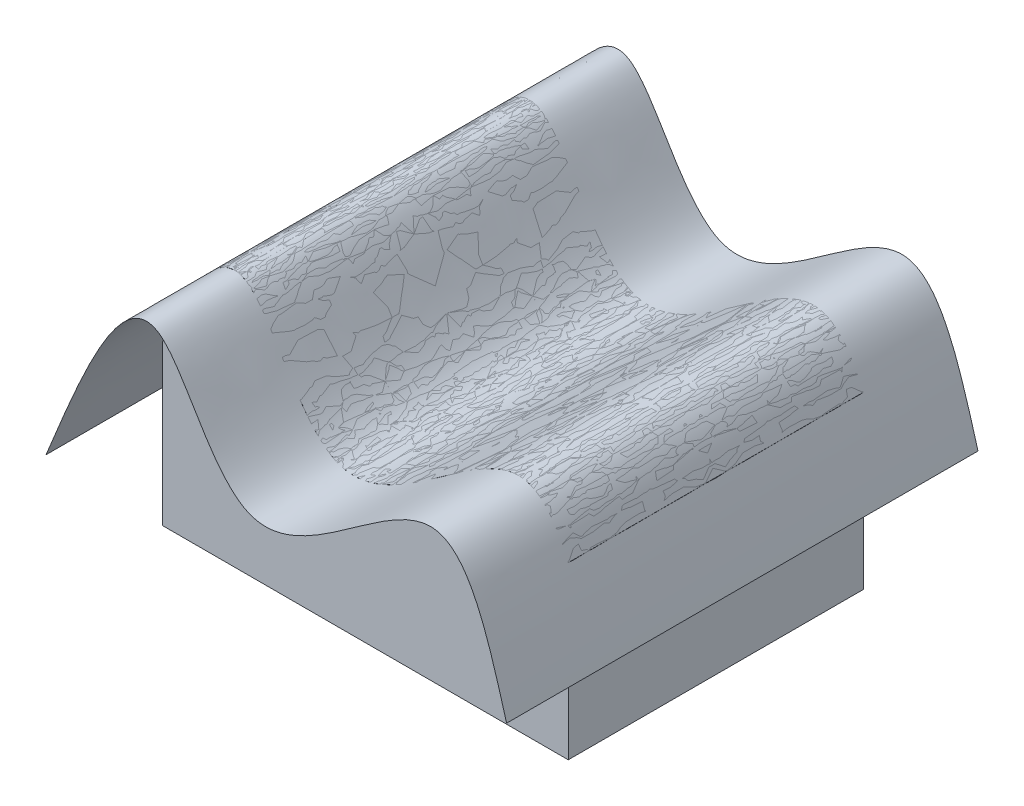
ISO-10303-21;
HEADER;
FILE_DESCRIPTION(('STEP AP214'),'2;1');
FILE_NAME('part.step','',(''),(''),'','','');
FILE_SCHEMA(('AUTOMOTIVE_DESIGN { 1 0 10303 214 1 1 1 1 }'));
ENDSEC;
DATA;
#1=APPLICATION_CONTEXT('core data for automotive mechanical design processes');
#2=APPLICATION_PROTOCOL_DEFINITION('international standard','automotive_design',2000,#1);
#3=PRODUCT_CONTEXT('',#1,'mechanical');
#4=PRODUCT('Part','Part','',(#3));
#5=PRODUCT_RELATED_PRODUCT_CATEGORY('part','',(#4));
#6=PRODUCT_DEFINITION_FORMATION('','',#4);
#7=PRODUCT_DEFINITION_CONTEXT('part definition',#1,'design');
#8=PRODUCT_DEFINITION('design','',#6,#7);
#9=PRODUCT_DEFINITION_SHAPE('','',#8);
#10=(LENGTH_UNIT() NAMED_UNIT(*) SI_UNIT(.MILLI.,.METRE.));
#11=(NAMED_UNIT(*) PLANE_ANGLE_UNIT() SI_UNIT($,.RADIAN.));
#12=(NAMED_UNIT(*) SI_UNIT($,.STERADIAN.) SOLID_ANGLE_UNIT());
#13=UNCERTAINTY_MEASURE_WITH_UNIT(LENGTH_MEASURE(1.E-05),#10,'distance_accuracy_value','');
#14=(GEOMETRIC_REPRESENTATION_CONTEXT(3) GLOBAL_UNCERTAINTY_ASSIGNED_CONTEXT((#13)) GLOBAL_UNIT_ASSIGNED_CONTEXT((#10,
#11,#12)) REPRESENTATION_CONTEXT('',''));
#15=CARTESIAN_POINT('',(0.,0.,0.));
#16=DIRECTION('',(0.,0.,1.));
#17=DIRECTION('',(1.,0.,0.));
#18=AXIS2_PLACEMENT_3D('',#15,#16,#17);
#19=CARTESIAN_POINT('',(-69.1741102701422,-2.69924633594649,-70.5138398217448));
#20=CARTESIAN_POINT('',(-57.8502774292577,25.0636272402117,-70.5138398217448));
#21=CARTESIAN_POINT('',(-38.1766225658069,73.2979309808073,-70.5138398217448));
#22=CARTESIAN_POINT('',(-9.11600174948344,-16.2820314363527,-70.5138398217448));
#23=CARTESIAN_POINT('',(50.3210809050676,60.8549096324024,-70.5138398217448));
#24=CARTESIAN_POINT('',(63.1056676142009,16.022012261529,-70.5138398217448));
#25=CARTESIAN_POINT('',(68.6261598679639,-3.33721054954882,-70.5138398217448));
#26=B_SPLINE_CURVE_WITH_KNOTS('',3,(#19,#20,#21,#22,#23,#24,#25),.UNSPECIFIED.,.F.,.F.,(4,1,1,1,
4),(0.,0.28457012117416,0.494402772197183,0.781678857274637,1.),.UNSPECIFIED.);
#27=DIRECTION('',(0.,0.,1.));
#28=VECTOR('',#27,1.);
#29=SURFACE_OF_LINEAR_EXTRUSION('',#26,#28);
#30=CARTESIAN_POINT('',(-69.1741102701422,-2.69924633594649,70.5138398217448));
#31=CARTESIAN_POINT('',(-57.8502774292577,25.0636272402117,70.5138398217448));
#32=CARTESIAN_POINT('',(-38.1766225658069,73.2979309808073,70.5138398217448));
#33=CARTESIAN_POINT('',(-9.11600174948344,-16.2820314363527,70.5138398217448));
#34=CARTESIAN_POINT('',(50.3210809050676,60.8549096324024,70.5138398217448));
#35=CARTESIAN_POINT('',(63.1056676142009,16.022012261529,70.5138398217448));
#36=CARTESIAN_POINT('',(68.6261598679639,-3.33721054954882,70.5138398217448));
#37=B_SPLINE_CURVE_WITH_KNOTS('',3,(#30,#31,#32,#33,#34,#35,#36),.UNSPECIFIED.,.F.,.F.,(4,1,1,1,
4),(0.,0.28457012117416,0.494402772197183,0.781678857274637,1.),.UNSPECIFIED.);
#38=CARTESIAN_POINT('',(-69.1741102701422,-2.69924633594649,70.5138398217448));
#39=VERTEX_POINT('',#38);
#40=CARTESIAN_POINT('',(68.6261598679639,-3.33721054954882,70.5138398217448));
#41=VERTEX_POINT('',#40);
#42=EDGE_CURVE('E64',#39,#41,#37,.T.);
#43=ORIENTED_EDGE('',*,*,#42,.F.);
#44=DIRECTION('',(0.,0.,1.));
#45=VECTOR('',#44,1.);
#46=CARTESIAN_POINT('',(-69.1741102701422,-2.69924633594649,-70.5138398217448));
#47=LINE('',#46,#45);
#48=CARTESIAN_POINT('',(-69.1741102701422,-2.69924633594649,-70.5138398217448));
#49=VERTEX_POINT('',#48);
#50=EDGE_CURVE('E46',#49,#39,#47,.T.);
#51=ORIENTED_EDGE('',*,*,#50,.F.);
#52=CARTESIAN_POINT('',(68.6261598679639,-3.33721054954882,-70.5138398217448));
#53=VERTEX_POINT('',#52);
#54=EDGE_CURVE('E52',#49,#53,#26,.T.);
#55=ORIENTED_EDGE('',*,*,#54,.T.);
#56=DIRECTION('',(0.,0.,1.));
#57=VECTOR('',#56,1.);
#58=CARTESIAN_POINT('',(68.6261598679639,-3.33721054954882,-70.5138398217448));
#59=LINE('',#58,#57);
#60=EDGE_CURVE('E12',#53,#41,#59,.T.);
#61=ORIENTED_EDGE('',*,*,#60,.T.);
#62=EDGE_LOOP('',(#43,#51,#55,#61));
#63=FACE_BOUND('',#62,.T.);
#64=ADVANCED_FACE('F44',(#63),#29,.T.);
#65=OPEN_SHELL('',(#64));
#66=SHELL_BASED_SURFACE_MODEL('B2',(#65));
#67=CARTESIAN_POINT('',(-60.6854417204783,-29.9963508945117,44.1280693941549));
#68=DIRECTION('',(1.,0.,0.));
#69=DIRECTION('',(0.,0.,-1.));
#70=AXIS2_PLACEMENT_3D('',#67,#68,#69);
#71=PLANE('',#70);
#72=DIRECTION('',(0.,-1.,0.));
#73=VECTOR('',#72,1.);
#74=CARTESIAN_POINT('',(-60.6854417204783,-29.9963508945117,-44.1280693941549));
#75=LINE('',#74,#73);
#76=CARTESIAN_POINT('',(-60.6854417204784,17.5855673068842,-44.1280693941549));
#77=VERTEX_POINT('',#76);
#78=CARTESIAN_POINT('',(-60.6854417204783,-29.9963508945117,-44.1280693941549));
#79=VERTEX_POINT('',#78);
#80=EDGE_CURVE('E157',#77,#79,#75,.T.);
#81=ORIENTED_EDGE('',*,*,#80,.T.);
#82=DIRECTION('',(0.,0.,-1.));
#83=VECTOR('',#82,1.);
#84=CARTESIAN_POINT('',(-60.6854417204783,-29.9963508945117,44.1280693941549));
#85=LINE('',#84,#83);
#86=CARTESIAN_POINT('',(-60.6854417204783,-29.9963508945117,44.1280693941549));
#87=VERTEX_POINT('',#86);
#88=EDGE_CURVE('E42',#87,#79,#85,.T.);
#89=ORIENTED_EDGE('',*,*,#88,.F.);
#90=DIRECTION('',(0.,-1.,0.));
#91=VECTOR('',#90,1.);
#92=CARTESIAN_POINT('',(-60.6854417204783,-29.9963508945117,44.1280693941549));
#93=LINE('',#92,#91);
#94=CARTESIAN_POINT('',(-60.6854417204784,17.5855673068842,44.1280693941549));
#95=VERTEX_POINT('',#94);
#96=EDGE_CURVE('E151',#95,#87,#93,.T.);
#97=ORIENTED_EDGE('',*,*,#96,.F.);
#98=DIRECTION('',(0.,0.,1.));
#99=VECTOR('',#98,1.);
#100=CARTESIAN_POINT('',(-60.6854417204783,17.5855673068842,0.));
#101=LINE('',#100,#99);
#102=EDGE_CURVE('E104',#95,#77,#101,.F.);
#103=ORIENTED_EDGE('',*,*,#102,.T.);
#104=EDGE_LOOP('',(#81,#89,#97,#103));
#105=FACE_BOUND('',#104,.T.);
#106=ADVANCED_FACE('F98',(#105),#71,.F.);
#107=CARTESIAN_POINT('',(-60.6854417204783,-29.9963508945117,44.1280693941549));
#108=DIRECTION('',(0.,1.,0.));
#109=DIRECTION('',(0.,0.,1.));
#110=AXIS2_PLACEMENT_3D('',#107,#108,#109);
#111=PLANE('',#110);
#112=DIRECTION('',(1.,0.,0.));
#113=VECTOR('',#112,1.);
#114=CARTESIAN_POINT('',(-60.6854417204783,-29.9963508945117,-44.1280693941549));
#115=LINE('',#114,#113);
#116=CARTESIAN_POINT('',(60.6854417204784,-29.9963508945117,-44.1280693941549));
#117=VERTEX_POINT('',#116);
#118=EDGE_CURVE('E159',#79,#117,#115,.T.);
#119=ORIENTED_EDGE('',*,*,#118,.T.);
#120=DIRECTION('',(0.,0.,-1.));
#121=VECTOR('',#120,1.);
#122=CARTESIAN_POINT('',(60.6854417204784,-29.9963508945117,44.1280693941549));
#123=LINE('',#122,#121);
#124=CARTESIAN_POINT('',(60.6854417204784,-29.9963508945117,44.1280693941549));
#125=VERTEX_POINT('',#124);
#126=EDGE_CURVE('E110',#125,#117,#123,.T.);
#127=ORIENTED_EDGE('',*,*,#126,.F.);
#128=DIRECTION('',(1.,0.,0.));
#129=VECTOR('',#128,1.);
#130=CARTESIAN_POINT('',(-60.6854417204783,-29.9963508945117,44.1280693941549));
#131=LINE('',#130,#129);
#132=EDGE_CURVE('E138',#87,#125,#131,.T.);
#133=ORIENTED_EDGE('',*,*,#132,.F.);
#134=ORIENTED_EDGE('',*,*,#88,.T.);
#135=EDGE_LOOP('',(#119,#127,#133,#134));
#136=FACE_BOUND('',#135,.T.);
#137=ADVANCED_FACE('F185',(#136),#111,.F.);
#138=CARTESIAN_POINT('',(60.6854417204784,-29.9963508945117,44.1280693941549));
#139=DIRECTION('',(-1.,0.,0.));
#140=DIRECTION('',(0.,-1.,0.));
#141=AXIS2_PLACEMENT_3D('',#138,#139,#140);
#142=PLANE('',#141);
#143=DIRECTION('',(0.,1.,0.));
#144=VECTOR('',#143,1.);
#145=CARTESIAN_POINT('',(60.6854417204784,-29.9963508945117,-44.1280693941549));
#146=LINE('',#145,#144);
#147=CARTESIAN_POINT('',(60.6854417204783,21.0898986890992,-44.1280693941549));
#148=VERTEX_POINT('',#147);
#149=EDGE_CURVE('E152',#117,#148,#146,.T.);
#150=ORIENTED_EDGE('',*,*,#149,.T.);
#151=DIRECTION('',(0.,0.,1.));
#152=VECTOR('',#151,1.);
#153=CARTESIAN_POINT('',(60.6854417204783,21.0898986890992,0.));
#154=LINE('',#153,#152);
#155=CARTESIAN_POINT('',(60.6854417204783,21.0898986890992,44.1280693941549));
#156=VERTEX_POINT('',#155);
#157=EDGE_CURVE('E147',#156,#148,#154,.F.);
#158=ORIENTED_EDGE('',*,*,#157,.F.);
#159=DIRECTION('',(0.,1.,0.));
#160=VECTOR('',#159,1.);
#161=CARTESIAN_POINT('',(60.6854417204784,-29.9963508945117,44.1280693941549));
#162=LINE('',#161,#160);
#163=EDGE_CURVE('E163',#125,#156,#162,.T.);
#164=ORIENTED_EDGE('',*,*,#163,.F.);
#165=ORIENTED_EDGE('',*,*,#126,.T.);
#166=EDGE_LOOP('',(#150,#158,#164,#165));
#167=FACE_BOUND('',#166,.T.);
#168=ADVANCED_FACE('F182',(#167),#142,.F.);
#169=CARTESIAN_POINT('',(-69.1741102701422,-2.69924633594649,-70.5138398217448));
#170=CARTESIAN_POINT('',(-57.8502774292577,25.0636272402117,-70.5138398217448));
#171=CARTESIAN_POINT('',(-38.1766225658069,73.2979309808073,-70.5138398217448));
#172=CARTESIAN_POINT('',(-9.11600174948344,-16.2820314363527,-70.5138398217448));
#173=CARTESIAN_POINT('',(50.3210809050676,60.8549096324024,-70.5138398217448));
#174=CARTESIAN_POINT('',(63.1056676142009,16.022012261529,-70.5138398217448));
#175=CARTESIAN_POINT('',(68.6261598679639,-3.33721054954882,-70.5138398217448));
#176=B_SPLINE_CURVE_WITH_KNOTS('',3,(#169,#170,#171,#172,#173,#174,#175),.UNSPECIFIED.,.F.,.F.,
(4,1,1,1,4),(0.,0.28457012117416,0.494402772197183,0.781678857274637,1.),.UNSPECIFIED.);
#177=DIRECTION('',(0.,0.,1.));
#178=VECTOR('',#177,1.);
#179=SURFACE_OF_LINEAR_EXTRUSION('',#176,#178);
#180=CARTESIAN_POINT('',(60.6854417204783,21.0898986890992,-44.1280693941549));
#181=CARTESIAN_POINT('',(60.5244460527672,21.4695030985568,-44.1280693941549));
#182=CARTESIAN_POINT('',(60.3604852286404,21.8478678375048,-44.1280693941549));
#183=CARTESIAN_POINT('',(60.0254467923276,22.6026398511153,-44.1280693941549));
#184=CARTESIAN_POINT('',(59.8543513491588,22.9790392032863,-44.1280693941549));
#185=CARTESIAN_POINT('',(59.5044409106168,23.7289445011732,-44.1280693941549));
#186=CARTESIAN_POINT('',(59.3256144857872,24.1024451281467,-44.1280693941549));
#187=CARTESIAN_POINT('',(58.9595060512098,24.8455427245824,-44.1280693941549));
#188=CARTESIAN_POINT('',(58.7722194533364,25.2151374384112,-44.1280693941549));
#189=CARTESIAN_POINT('',(58.384620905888,25.9564427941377,-44.1280693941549));
#190=CARTESIAN_POINT('',(58.1841287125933,26.3280594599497,-44.1280693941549));
#191=CARTESIAN_POINT('',(57.7723297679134,27.0649642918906,-44.1280693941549));
#192=CARTESIAN_POINT('',(57.5610299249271,27.4302563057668,-44.1280693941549));
#193=CARTESIAN_POINT('',(57.1262681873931,28.1531784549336,-44.1280693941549));
#194=CARTESIAN_POINT('',(56.9028155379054,28.5108141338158,-44.1280693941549));
#195=CARTESIAN_POINT('',(56.4420851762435,29.2169355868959,-44.1280693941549));
#196=CARTESIAN_POINT('',(56.2048126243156,29.565424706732,-44.1280693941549));
#197=CARTESIAN_POINT('',(55.8068960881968,30.1220654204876,-44.1280693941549));
#198=CARTESIAN_POINT('',(55.651042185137,30.3336468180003,-44.1280693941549));
#199=CARTESIAN_POINT('',(55.3327411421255,30.751830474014,-44.1280693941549));
#200=CARTESIAN_POINT('',(55.1702935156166,30.9584323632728,-44.1280693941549));
#201=CARTESIAN_POINT('',(54.8382993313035,31.3659069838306,-44.1280693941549));
#202=CARTESIAN_POINT('',(54.6687518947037,31.566779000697,-44.1280693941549));
#203=CARTESIAN_POINT('',(54.3225433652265,31.9613274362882,-44.1280693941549));
#204=CARTESIAN_POINT('',(54.1459033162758,32.1550222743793,-44.1280693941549));
#205=CARTESIAN_POINT('',(53.7845729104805,32.5347537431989,-44.1280693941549));
#206=CARTESIAN_POINT('',(53.5998830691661,32.7207908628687,-44.1280693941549));
#207=CARTESIAN_POINT('',(53.2219939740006,33.0839832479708,-44.1280693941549));
#208=CARTESIAN_POINT('',(53.0287957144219,33.2611395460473,-44.1280693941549));
#209=CARTESIAN_POINT('',(52.5861191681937,33.6464011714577,-44.1280693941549));
#210=CARTESIAN_POINT('',(52.3342370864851,33.8517669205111,-44.1280693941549));
#211=CARTESIAN_POINT('',(51.8162511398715,34.2436900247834,-44.1280693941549));
#212=CARTESIAN_POINT('',(51.5501502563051,34.4302512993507,-44.1280693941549));
#213=CARTESIAN_POINT('',(51.0040042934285,34.7809841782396,-44.1280693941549));
#214=CARTESIAN_POINT('',(50.7239785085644,34.9451856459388,-44.1280693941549));
#215=CARTESIAN_POINT('',(50.1503541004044,35.2479314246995,-44.1280693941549));
#216=CARTESIAN_POINT('',(49.8567583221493,35.3864810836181,-44.1280693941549));
#217=CARTESIAN_POINT('',(49.3046750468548,35.6151282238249,-44.1280693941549));
#218=CARTESIAN_POINT('',(49.0479228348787,35.7094184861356,-44.1280693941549));
#219=CARTESIAN_POINT('',(48.5273513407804,35.8758539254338,-44.1280693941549));
#220=CARTESIAN_POINT('',(48.2635329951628,35.9480020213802,-44.1280693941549));
#221=CARTESIAN_POINT('',(47.7308143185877,36.0690689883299,-44.1280693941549));
#222=CARTESIAN_POINT('',(47.4619184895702,36.118007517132,-44.1280693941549));
#223=CARTESIAN_POINT('',(47.0562277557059,36.1738294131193,-44.1280693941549));
#224=CARTESIAN_POINT('',(46.9205884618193,36.1895066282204,-44.1280693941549));
#225=CARTESIAN_POINT('',(46.6487592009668,36.215022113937,-44.1280693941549));
#226=CARTESIAN_POINT('',(46.5125692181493,36.2248602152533,-44.1280693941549));
#227=CARTESIAN_POINT('',(46.0311081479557,36.2496060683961,-44.1280693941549));
#228=CARTESIAN_POINT('',(45.6849670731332,36.2492142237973,-44.1280693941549));
#229=CARTESIAN_POINT('',(44.9942102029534,36.2169202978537,-44.1280693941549));
#230=CARTESIAN_POINT('',(44.6495953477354,36.1850009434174,-44.1280693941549));
#231=CARTESIAN_POINT('',(43.9626485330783,36.0942300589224,-44.1280693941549));
#232=CARTESIAN_POINT('',(43.620330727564,36.0352739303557,-44.1280693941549));
#233=CARTESIAN_POINT('',(42.9405391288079,35.8947701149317,-44.1280693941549));
#234=CARTESIAN_POINT('',(42.6030643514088,35.813227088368,-44.1280693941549));
#235=CARTESIAN_POINT('',(41.8305153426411,35.60335962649,-44.1280693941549));
#236=CARTESIAN_POINT('',(41.3972662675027,35.4683580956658,-44.1280693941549));
#237=CARTESIAN_POINT('',(40.5392181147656,35.1727218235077,-44.1280693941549));
#238=CARTESIAN_POINT('',(40.114428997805,35.012058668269,-44.1280693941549));
#239=CARTESIAN_POINT('',(39.2726066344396,34.670116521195,-44.1280693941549));
#240=CARTESIAN_POINT('',(38.8555850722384,34.4888089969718,-44.1280693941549));
#241=CARTESIAN_POINT('',(38.029044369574,34.1097161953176,-44.1280693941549));
#242=CARTESIAN_POINT('',(37.6195268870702,33.9119273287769,-44.1280693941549));
#243=CARTESIAN_POINT('',(36.8049787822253,33.501867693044,-44.1280693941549));
#244=CARTESIAN_POINT('',(36.399985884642,33.289522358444,-44.1280693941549));
#245=CARTESIAN_POINT('',(35.5964319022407,32.8540601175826,-44.1280693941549));
#246=CARTESIAN_POINT('',(35.1978642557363,32.6309552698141,-44.1280693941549));
#247=CARTESIAN_POINT('',(34.406126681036,32.1758487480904,-44.1280693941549));
#248=CARTESIAN_POINT('',(34.0129541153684,31.9438516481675,-44.1280693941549));
#249=CARTESIAN_POINT('',(33.2311709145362,31.4725014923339,-44.1280693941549));
#250=CARTESIAN_POINT('',(32.8425593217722,31.2331500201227,-44.1280693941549));
#251=CARTESIAN_POINT('',(31.8796003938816,30.6295635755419,-44.1280693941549));
#252=CARTESIAN_POINT('',(31.307579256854,30.2616214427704,-44.1280693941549));
#253=CARTESIAN_POINT('',(30.1700515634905,29.5157823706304,-44.1280693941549));
#254=CARTESIAN_POINT('',(29.6045453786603,29.1378848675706,-44.1280693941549));
#255=CARTESIAN_POINT('',(28.478033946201,28.3747287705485,-44.1280693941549));
#256=CARTESIAN_POINT('',(27.9170316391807,27.9894658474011,-44.1280693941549));
#257=CARTESIAN_POINT('',(26.7983617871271,27.2141662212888,-44.1280693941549));
#258=CARTESIAN_POINT('',(26.2406941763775,26.8241296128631,-44.1280693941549));
#259=CARTESIAN_POINT('',(25.1269750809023,26.0410988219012,-44.1280693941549));
#260=CARTESIAN_POINT('',(24.5709246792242,25.6481031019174,-44.1280693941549));
#261=CARTESIAN_POINT('',(23.4594483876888,24.8612327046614,-44.1280693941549));
#262=CARTESIAN_POINT('',(22.9040224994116,24.4673580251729,-44.1280693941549));
#263=CARTESIAN_POINT('',(21.2426744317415,23.2911894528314,-44.1280693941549));
#264=CARTESIAN_POINT('',(20.1358263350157,22.5101779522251,-44.1280693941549));
#265=CARTESIAN_POINT('',(18.4667567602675,21.3519008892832,-44.1280693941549));
#266=CARTESIAN_POINT('',(17.9090778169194,20.9681117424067,-44.1280693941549));
#267=CARTESIAN_POINT('',(16.7894688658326,20.2067934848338,-44.1280693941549));
#268=CARTESIAN_POINT('',(16.2275389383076,19.8292642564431,-44.1280693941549));
#269=CARTESIAN_POINT('',(15.098356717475,19.082716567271,-44.1280693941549));
#270=CARTESIAN_POINT('',(14.5311066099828,18.7136948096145,-44.1280693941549));
#271=CARTESIAN_POINT('',(13.389736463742,17.9864556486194,-44.1280693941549));
#272=CARTESIAN_POINT('',(12.8156167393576,17.6282377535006,-44.1280693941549));
#273=CARTESIAN_POINT('',(11.6608604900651,16.9265757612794,-44.1280693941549));
#274=CARTESIAN_POINT('',(11.0802501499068,16.5830887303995,-44.1280693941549));
#275=CARTESIAN_POINT('',(9.90915324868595,15.9131280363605,-44.1280693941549));
#276=CARTESIAN_POINT('',(9.31866549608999,15.5866564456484,-44.1280693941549));
#277=CARTESIAN_POINT('',(8.12398895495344,14.9538800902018,-44.1280693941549));
#278=CARTESIAN_POINT('',(7.51975590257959,14.6476584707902,-44.1280693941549));
#279=CARTESIAN_POINT('',(6.29820199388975,14.0623264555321,-44.1280693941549));
#280=CARTESIAN_POINT('',(5.68088195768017,13.7832143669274,-44.1280693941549));
#281=CARTESIAN_POINT('',(4.63398030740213,13.3441524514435,-44.1280693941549));
#282=CARTESIAN_POINT('',(4.208313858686,13.1748762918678,-44.1280693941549));
#283=CARTESIAN_POINT('',(3.34999453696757,12.8548131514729,-44.1280693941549));
#284=CARTESIAN_POINT('',(2.91734109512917,12.7040276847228,-44.1280693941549));
#285=CARTESIAN_POINT('',(2.04473278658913,12.4241798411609,-44.1280693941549));
#286=CARTESIAN_POINT('',(1.60477385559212,12.2951300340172,-44.1280693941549));
#287=CARTESIAN_POINT('',(0.720138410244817,12.0633168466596,-44.1280693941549));
#288=CARTESIAN_POINT('',(0.275494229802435,11.9604315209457,-44.1280693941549));
#289=CARTESIAN_POINT('',(-0.619564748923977,11.7846419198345,-44.1280693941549));
#290=CARTESIAN_POINT('',(-1.06997684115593,11.7117240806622,-44.1280693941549));
#291=CARTESIAN_POINT('',(-1.97473196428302,11.6008149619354,-44.1280693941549));
#292=CARTESIAN_POINT('',(-2.42907016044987,11.5627855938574,-44.1280693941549));
#293=CARTESIAN_POINT('',(-3.26119582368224,11.5297528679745,-44.1280693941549));
#294=CARTESIAN_POINT('',(-3.63872797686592,11.5284812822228,-44.1280693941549));
#295=CARTESIAN_POINT('',(-4.39273398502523,11.5560443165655,-44.1280693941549));
#296=CARTESIAN_POINT('',(-4.7692079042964,11.5848770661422,-44.1280693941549));
#297=CARTESIAN_POINT('',(-5.51739961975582,11.6747846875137,-44.1280693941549));
#298=CARTESIAN_POINT('',(-5.88912734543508,11.7357742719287,-44.1280693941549));
#299=CARTESIAN_POINT('',(-6.44129673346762,11.852332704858,-44.1280693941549));
#300=CARTESIAN_POINT('',(-6.6244556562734,11.8953664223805,-44.1280693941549));
#301=CARTESIAN_POINT('',(-6.98860271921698,11.9898480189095,-44.1280693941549));
#302=CARTESIAN_POINT('',(-7.16959089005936,12.0412957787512,-44.1280693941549));
#303=CARTESIAN_POINT('',(-7.52907673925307,12.1526180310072,-44.1280693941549));
#304=CARTESIAN_POINT('',(-7.70757282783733,12.21249765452,-44.1280693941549));
#305=CARTESIAN_POINT('',(-8.06155269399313,12.3405757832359,-44.1280693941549));
#306=CARTESIAN_POINT('',(-8.23703646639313,12.4087743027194,-44.1280693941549));
#307=CARTESIAN_POINT('',(-8.58479668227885,12.5529647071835,-44.1280693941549));
#308=CARTESIAN_POINT('',(-8.75707264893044,12.6289577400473,-44.1280693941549));
#309=CARTESIAN_POINT('',(-9.09824883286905,12.7881517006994,-44.1280693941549));
#310=CARTESIAN_POINT('',(-9.26714898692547,12.8713527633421,-44.1280693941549));
#311=CARTESIAN_POINT('',(-9.7696736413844,13.1314561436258,-44.1280693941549));
#312=CARTESIAN_POINT('',(-10.098124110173,13.3184389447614,-44.1280693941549));
#313=CARTESIAN_POINT('',(-10.7410288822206,13.7148857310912,-44.1280693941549));
#314=CARTESIAN_POINT('',(-11.0554820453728,13.9243515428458,-44.1280693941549));
#315=CARTESIAN_POINT('',(-11.734408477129,14.4071677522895,-44.1280693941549));
#316=CARTESIAN_POINT('',(-12.0958379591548,14.6847884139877,-44.1280693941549));
#317=CARTESIAN_POINT('',(-12.8008922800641,15.2620818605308,-44.1280693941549));
#318=CARTESIAN_POINT('',(-13.1445043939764,15.5617700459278,-44.1280693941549));
#319=CARTESIAN_POINT('',(-13.8155688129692,16.1788553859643,-44.1280693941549));
#320=CARTESIAN_POINT('',(-14.1430155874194,16.4962585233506,-44.1280693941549));
#321=CARTESIAN_POINT('',(-14.7841498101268,17.1460497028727,-44.1280693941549));
#322=CARTESIAN_POINT('',(-15.0978036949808,17.4784706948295,-44.1280693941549));
#323=CARTESIAN_POINT('',(-15.7121090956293,18.1547857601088,-44.1280693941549));
#324=CARTESIAN_POINT('',(-16.0127666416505,18.4986743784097,-44.1280693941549));
#325=CARTESIAN_POINT('',(-16.6027521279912,19.1959115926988,-44.1280693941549));
#326=CARTESIAN_POINT('',(-16.8920818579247,19.5492586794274,-44.1280693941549));
#327=CARTESIAN_POINT('',(-17.4281844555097,20.2227209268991,-44.1280693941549));
#328=CARTESIAN_POINT('',(-17.6760265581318,20.5419879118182,-44.1280693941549));
#329=CARTESIAN_POINT('',(-18.16487091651,21.1857237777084,-44.1280693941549));
#330=CARTESIAN_POINT('',(-18.4058729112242,21.5101928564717,-44.1280693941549));
#331=CARTESIAN_POINT('',(-19.1200437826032,22.4904377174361,-44.1280693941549));
#332=CARTESIAN_POINT('',(-19.5841787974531,23.1527984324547,-44.1280693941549));
#333=CARTESIAN_POINT('',(-20.4943411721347,24.4903982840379,-44.1280693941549));
#334=CARTESIAN_POINT('',(-20.9403559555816,25.165645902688,-44.1280693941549));
#335=CARTESIAN_POINT('',(-21.818971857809,26.52493816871,-44.1280693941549));
#336=CARTESIAN_POINT('',(-22.2515707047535,27.2089842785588,-44.1280693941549));
#337=CARTESIAN_POINT('',(-23.1086601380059,28.5840936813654,-44.1280693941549));
#338=CARTESIAN_POINT('',(-23.533131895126,29.2751686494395,-44.1280693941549));
#339=CARTESIAN_POINT('',(-24.3771636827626,30.6598030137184,-44.1280693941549));
#340=CARTESIAN_POINT('',(-24.7967261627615,31.3533609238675,-44.1280693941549));
#341=CARTESIAN_POINT('',(-25.635462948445,32.7403574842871,-44.1280693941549));
#342=CARTESIAN_POINT('',(-26.0546373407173,33.4337960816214,-44.1280693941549));
#343=CARTESIAN_POINT('',(-26.6869141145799,34.4717121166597,-44.1280693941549));
#344=CARTESIAN_POINT('',(-26.8982351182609,34.8172720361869,-44.1280693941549));
#345=CARTESIAN_POINT('',(-27.3227799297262,35.5072199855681,-44.1280693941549));
#346=CARTESIAN_POINT('',(-27.536003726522,35.8516080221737,-44.1280693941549));
#347=CARTESIAN_POINT('',(-27.9650405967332,36.538541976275,-44.1280693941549));
#348=CARTESIAN_POINT('',(-28.1808523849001,36.8810886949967,-44.1280693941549));
#349=CARTESIAN_POINT('',(-28.6161089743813,37.5639612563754,-44.1280693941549));
#350=CARTESIAN_POINT('',(-28.8355544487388,37.9042866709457,-44.1280693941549));
#351=CARTESIAN_POINT('',(-29.2791923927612,38.5820562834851,-44.1280693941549));
#352=CARTESIAN_POINT('',(-29.5033869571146,38.9194991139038,-44.1280693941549));
#353=CARTESIAN_POINT('',(-29.9578811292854,39.5906852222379,-44.1280693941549));
#354=CARTESIAN_POINT('',(-30.1881858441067,39.9244250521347,-44.1280693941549));
#355=CARTESIAN_POINT('',(-30.6555282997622,40.5856355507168,-44.1280693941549));
#356=CARTESIAN_POINT('',(-30.8925430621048,40.9131223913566,-44.1280693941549));
#357=CARTESIAN_POINT('',(-31.3758215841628,41.5611180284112,-44.1280693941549));
#358=CARTESIAN_POINT('',(-31.6220833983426,41.8816282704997,-44.1280693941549));
#359=CARTESIAN_POINT('',(-32.1260303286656,42.5130512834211,-44.1280693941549));
#360=CARTESIAN_POINT('',(-32.3837024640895,42.8239743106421,-44.1280693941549));
#361=CARTESIAN_POINT('',(-32.7811552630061,43.2806250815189,-44.1280693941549));
#362=CARTESIAN_POINT('',(-32.9154112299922,43.4311650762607,-44.1280693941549));
#363=CARTESIAN_POINT('',(-33.1880803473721,43.7284268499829,-44.1280693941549));
#364=CARTESIAN_POINT('',(-33.3264932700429,43.8751488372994,-44.1280693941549));
#365=CARTESIAN_POINT('',(-33.6508477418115,44.2080103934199,-44.1280693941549));
#366=CARTESIAN_POINT('',(-33.8384340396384,44.3925566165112,-44.1280693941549));
#367=CARTESIAN_POINT('',(-34.2230005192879,44.7518147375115,-44.1280693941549));
#368=CARTESIAN_POINT('',(-34.4199834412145,44.9265237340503,-44.1280693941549));
#369=CARTESIAN_POINT('',(-34.7232959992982,45.1786207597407,-44.1280693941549));
#370=CARTESIAN_POINT('',(-34.8255745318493,45.2608958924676,-44.1280693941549));
#371=CARTESIAN_POINT('',(-35.0330200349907,45.4217211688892,-44.1280693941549));
#372=CARTESIAN_POINT('',(-35.138186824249,45.5002715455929,-44.1280693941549));
#373=CARTESIAN_POINT('',(-35.3515333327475,45.6530437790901,-44.1280693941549));
#374=CARTESIAN_POINT('',(-35.4597111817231,45.7272682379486,-44.1280693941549));
#375=CARTESIAN_POINT('',(-35.6793411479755,45.8707641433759,-44.1280693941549));
#376=CARTESIAN_POINT('',(-35.7907939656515,45.9400345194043,-44.1280693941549));
#377=CARTESIAN_POINT('',(-36.0588081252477,46.0976179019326,-44.1280693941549));
#378=CARTESIAN_POINT('',(-36.2168118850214,46.1835023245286,-44.1280693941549));
#379=CARTESIAN_POINT('',(-36.5387415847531,46.34334212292,-44.1280693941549));
#380=CARTESIAN_POINT('',(-36.7026667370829,46.4172990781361,-44.1280693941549));
#381=CARTESIAN_POINT('',(-37.0358687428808,46.5517179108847,-44.1280693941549));
#382=CARTESIAN_POINT('',(-37.2051419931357,46.6121886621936,-44.1280693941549));
#383=CARTESIAN_POINT('',(-37.5483014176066,46.7182762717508,-44.1280693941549));
#384=CARTESIAN_POINT('',(-37.7221874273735,46.7638936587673,-44.1280693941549));
#385=CARTESIAN_POINT('',(-38.0746889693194,46.8394227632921,-44.1280693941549));
#386=CARTESIAN_POINT('',(-38.2533297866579,46.8692172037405,-44.1280693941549));
#387=CARTESIAN_POINT('',(-38.612620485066,46.9119085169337,-44.1280693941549));
#388=CARTESIAN_POINT('',(-38.7932703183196,46.9248057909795,-44.1280693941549));
#389=CARTESIAN_POINT('',(-39.1550483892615,46.9336158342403,-44.1280693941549));
#390=CARTESIAN_POINT('',(-39.3361767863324,46.9295219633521,-44.1280693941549));
#391=CARTESIAN_POINT('',(-39.6972974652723,46.9048490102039,-44.1280693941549));
#392=CARTESIAN_POINT('',(-39.8772896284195,46.8842682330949,-44.1280693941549));
#393=CARTESIAN_POINT('',(-40.2575833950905,46.8240075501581,-44.1280693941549));
#394=CARTESIAN_POINT('',(-40.4575525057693,46.782229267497,-44.1280693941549));
#395=CARTESIAN_POINT('',(-40.8528771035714,46.6809368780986,-44.1280693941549));
#396=CARTESIAN_POINT('',(-41.0482318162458,46.6214198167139,-44.1280693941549));
#397=CARTESIAN_POINT('',(-41.6265309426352,46.4192822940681,-44.1280693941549));
#398=CARTESIAN_POINT('',(-42.0014119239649,46.2531283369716,-44.1280693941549));
#399=CARTESIAN_POINT('',(-42.5153026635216,45.9849239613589,-44.1280693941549));
#400=CARTESIAN_POINT('',(-42.6647994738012,45.9017222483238,-44.1280693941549));
#401=CARTESIAN_POINT('',(-42.9596110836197,45.7282064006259,-44.1280693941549));
#402=CARTESIAN_POINT('',(-43.1049267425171,45.6378937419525,-44.1280693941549));
#403=CARTESIAN_POINT('',(-43.5349657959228,45.3575165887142,-44.1280693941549));
#404=CARTESIAN_POINT('',(-43.8136042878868,45.158107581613,-44.1280693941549));
#405=CARTESIAN_POINT('',(-44.3567712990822,44.7396507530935,-44.1280693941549));
#406=CARTESIAN_POINT('',(-44.6212574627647,44.5205487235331,-44.1280693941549));
#407=CARTESIAN_POINT('',(-45.1369005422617,44.0674514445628,-44.1280693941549));
#408=CARTESIAN_POINT('',(-45.3880620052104,43.8334613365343,-44.1280693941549));
#409=CARTESIAN_POINT('',(-45.9425542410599,43.2912477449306,-44.1280693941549));
#410=CARTESIAN_POINT('',(-46.2424673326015,42.9795432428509,-44.1280693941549));
#411=CARTESIAN_POINT('',(-46.8267918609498,42.3415877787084,-44.1280693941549));
#412=CARTESIAN_POINT('',(-47.1111907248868,42.0153253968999,-44.1280693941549));
#413=CARTESIAN_POINT('',(-47.6669122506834,41.351142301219,-44.1280693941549));
#414=CARTESIAN_POINT('',(-47.9382165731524,41.0132063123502,-44.1280693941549));
#415=CARTESIAN_POINT('',(-48.4694660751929,40.3280534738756,-44.1280693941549));
#416=CARTESIAN_POINT('',(-48.7294004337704,39.9808282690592,-44.1280693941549));
#417=CARTESIAN_POINT('',(-49.2391705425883,39.2791085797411,-44.1280693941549));
#418=CARTESIAN_POINT('',(-49.4890071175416,38.924614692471,-44.1280693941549));
#419=CARTESIAN_POINT('',(-49.9818716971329,38.2067012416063,-44.1280693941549));
#420=CARTESIAN_POINT('',(-50.224828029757,37.8432326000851,-44.1280693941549));
#421=CARTESIAN_POINT('',(-50.702624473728,37.1115708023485,-44.1280693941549));
#422=CARTESIAN_POINT('',(-50.9374730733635,36.7433831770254,-44.1280693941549));
#423=CARTESIAN_POINT('',(-51.4000935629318,36.0029076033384,-44.1280693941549));
#424=CARTESIAN_POINT('',(-51.6278696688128,35.6306222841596,-44.1280693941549));
#425=CARTESIAN_POINT('',(-52.07719396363,34.8824601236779,-44.1280693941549));
#426=CARTESIAN_POINT('',(-52.2987438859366,34.5065843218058,-44.1280693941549));
#427=CARTESIAN_POINT('',(-52.7363196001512,33.7516623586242,-44.1280693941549));
#428=CARTESIAN_POINT('',(-52.9523456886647,33.3726163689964,-44.1280693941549));
#429=CARTESIAN_POINT('',(-53.4022377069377,32.5711424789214,-44.1280693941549));
#430=CARTESIAN_POINT('',(-53.6355468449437,32.1484022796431,-44.1280693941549));
#431=CARTESIAN_POINT('',(-54.0967885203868,31.2999091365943,-44.1280693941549));
#432=CARTESIAN_POINT('',(-54.3247201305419,30.874155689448,-44.1280693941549));
#433=CARTESIAN_POINT('',(-54.7757728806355,30.0199948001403,-44.1280693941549));
#434=CARTESIAN_POINT('',(-54.9988929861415,29.5915868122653,-44.1280693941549));
#435=CARTESIAN_POINT('',(-55.4408045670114,28.7324334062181,-44.1280693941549));
#436=CARTESIAN_POINT('',(-55.6595951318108,28.3016875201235,-44.1280693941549));
#437=CARTESIAN_POINT('',(-56.0932618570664,27.4381400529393,-44.1280693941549));
#438=CARTESIAN_POINT('',(-56.3081373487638,27.0053381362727,-44.1280693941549));
#439=CARTESIAN_POINT('',(-56.7343333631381,26.1379322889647,-44.1280693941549));
#440=CARTESIAN_POINT('',(-56.9456535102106,25.7033281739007,-44.1280693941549));
#441=CARTESIAN_POINT('',(-57.3593001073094,24.8444931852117,-44.1280693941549));
#442=CARTESIAN_POINT('',(-57.5617143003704,24.4203045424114,-44.1280693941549));
#443=CARTESIAN_POINT('',(-57.9637322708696,23.5706361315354,-44.1280693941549));
#444=CARTESIAN_POINT('',(-58.1633362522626,23.1451564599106,-44.1280693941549));
#445=CARTESIAN_POINT('',(-58.5599580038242,22.2930931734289,-44.1280693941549));
#446=CARTESIAN_POINT('',(-58.7569762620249,21.8665097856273,-44.1280693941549));
#447=CARTESIAN_POINT('',(-59.1486263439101,21.012414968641,-44.1280693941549));
#448=CARTESIAN_POINT('',(-59.3432589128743,20.5849038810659,-44.1280693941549));
#449=CARTESIAN_POINT('',(-59.7303178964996,19.7291208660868,-44.1280693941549));
#450=CARTESIAN_POINT('',(-59.922745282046,19.3008493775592,-44.1280693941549));
#451=CARTESIAN_POINT('',(-60.3055526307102,18.4437021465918,-44.1280693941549));
#452=CARTESIAN_POINT('',(-60.4959337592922,18.0148269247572,-44.1280693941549));
#453=CARTESIAN_POINT('',(-60.6854417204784,17.5855673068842,-44.1280693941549));
#454=B_SPLINE_CURVE_WITH_KNOTS('',3,(#180,#181,#182,#183,#184,#185,#186,#187,#188,#189,#190,
#191,#192,#193,#194,#195,#196,#197,#198,#199,#200,#201,#202,#203,#204,#205,#206,#207,#208,#209,
#210,#211,#212,#213,#214,#215,#216,#217,#218,#219,#220,#221,#222,#223,#224,#225,#226,#227,#228,
#229,#230,#231,#232,#233,#234,#235,#236,#237,#238,#239,#240,#241,#242,#243,#244,#245,#246,#247,
#248,#249,#250,#251,#252,#253,#254,#255,#256,#257,#258,#259,#260,#261,#262,#263,#264,#265,#266,
#267,#268,#269,#270,#271,#272,#273,#274,#275,#276,#277,#278,#279,#280,#281,#282,#283,#284,#285,
#286,#287,#288,#289,#290,#291,#292,#293,#294,#295,#296,#297,#298,#299,#300,#301,#302,#303,#304,
#305,#306,#307,#308,#309,#310,#311,#312,#313,#314,#315,#316,#317,#318,#319,#320,#321,#322,#323,
#324,#325,#326,#327,#328,#329,#330,#331,#332,#333,#334,#335,#336,#337,#338,#339,#340,#341,#342,
#343,#344,#345,#346,#347,#348,#349,#350,#351,#352,#353,#354,#355,#356,#357,#358,#359,#360,#361,
#362,#363,#364,#365,#366,#367,#368,#369,#370,#371,#372,#373,#374,#375,#376,#377,#378,#379,#380,
#381,#382,#383,#384,#385,#386,#387,#388,#389,#390,#391,#392,#393,#394,#395,#396,#397,#398,#399,
#400,#401,#402,#403,#404,#405,#406,#407,#408,#409,#410,#411,#412,#413,#414,#415,#416,#417,#418,
#419,#420,#421,#422,#423,#424,#425,#426,#427,#428,#429,#430,#431,#432,#433,#434,#435,#436,#437,
#438,#439,#440,#441,#442,#443,#444,#445,#446,#447,#448,#449,#450,#451,#452,#453),.UNSPECIFIED.,
.F.,.F.,(4,2,2,2,2,2,2,2,2,2,2,2,2,2,2,2,2,2,2,2,2,2,2,2,2,2,2,2,2,2,2,2,2,2,2,2,2,2,2,2,2,2,2,
2,2,2,2,2,2,2,2,2,2,2,2,2,2,2,2,2,2,2,2,2,2,2,2,2,2,2,2,2,2,2,2,2,2,2,2,2,2,2,2,2,2,2,2,2,2,2,2,
2,2,2,2,2,2,2,2,2,2,2,2,2,2,2,2,2,2,2,2,2,2,2,2,2,2,2,2,2,2,2,2,2,2,2,2,2,2,2,2,2,2,2,2,2,4),
(0.,1.23701320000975,2.47732883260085,3.71954543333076,4.96244399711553,6.22903614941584,
7.49482855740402,8.75967114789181,10.0240444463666,10.8122967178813,11.600607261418,
12.3890156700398,13.1752364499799,13.9614069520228,14.7474858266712,15.7216867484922,
16.6956841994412,17.6683677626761,18.6408483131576,19.4604716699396,20.2799869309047,
21.0988068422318,21.5083238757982,21.9178527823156,22.9543885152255,23.9914924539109,
25.0326429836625,26.0735788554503,27.4339065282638,28.7957510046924,30.1595010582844,
31.5235488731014,32.8951986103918,34.2653452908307,35.6347964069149,37.0039546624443,
39.0442184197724,41.0845979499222,43.1262160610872,45.1677938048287,47.2105176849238,
49.2532467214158,53.3171332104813,55.3480374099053,57.3789033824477,59.4089686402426,
61.4389413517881,63.462527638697,65.4863598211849,67.5180429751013,69.5495991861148,
70.9235190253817,72.2975512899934,73.6723754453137,75.040669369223,76.4083432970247,
77.7745223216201,78.906046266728,80.0374999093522,81.1659676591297,81.7302400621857,
82.2945044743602,82.8591137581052,83.4237240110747,83.9884175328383,84.5531216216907,
85.6857686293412,86.8185077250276,88.1846450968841,89.5517450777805,90.9193095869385,
92.2900360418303,93.6601195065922,95.029985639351,96.2424075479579,97.4548756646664,
99.880775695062,102.308331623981,104.736296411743,107.169334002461,109.601100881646,
112.031955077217,113.247110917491,114.46225974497,115.676828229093,116.891624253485,
118.106967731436,119.323361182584,120.535999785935,121.748384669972,122.959424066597,
123.564490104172,124.169523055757,124.958690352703,125.748089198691,126.141810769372,
126.53550767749,126.928965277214,127.322507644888,127.861553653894,128.400528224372,
128.939147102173,129.477746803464,130.020284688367,130.56280968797,131.105546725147,
131.648339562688,132.260252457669,132.872267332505,134.097194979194,134.610384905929,
135.123468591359,136.150235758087,137.179921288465,138.209253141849,139.506253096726,
140.804288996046,142.10409301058,143.405108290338,144.706017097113,146.017478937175,
147.327523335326,148.636771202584,149.945650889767,151.254460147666,152.70295961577,
154.151707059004,155.600762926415,157.050120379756,158.499723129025,159.949478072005,
161.359490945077,162.769400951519,164.179040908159,165.588228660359,166.99677010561,
168.404461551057),.UNSPECIFIED.);
#455=EDGE_CURVE('E143',#148,#77,#454,.T.);
#456=ORIENTED_EDGE('',*,*,#455,.T.);
#457=ORIENTED_EDGE('',*,*,#102,.F.);
#458=CARTESIAN_POINT('',(60.6854417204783,21.0898986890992,44.1280693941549));
#459=CARTESIAN_POINT('',(60.5244460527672,21.4695030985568,44.1280693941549));
#460=CARTESIAN_POINT('',(60.3604852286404,21.8478678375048,44.1280693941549));
#461=CARTESIAN_POINT('',(60.0254467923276,22.6026398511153,44.1280693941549));
#462=CARTESIAN_POINT('',(59.8543513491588,22.9790392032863,44.1280693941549));
#463=CARTESIAN_POINT('',(59.5044409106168,23.7289445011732,44.1280693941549));
#464=CARTESIAN_POINT('',(59.3256144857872,24.1024451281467,44.1280693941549));
#465=CARTESIAN_POINT('',(58.9595060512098,24.8455427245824,44.1280693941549));
#466=CARTESIAN_POINT('',(58.7722194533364,25.2151374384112,44.1280693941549));
#467=CARTESIAN_POINT('',(58.384620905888,25.9564427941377,44.1280693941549));
#468=CARTESIAN_POINT('',(58.1841287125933,26.3280594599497,44.1280693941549));
#469=CARTESIAN_POINT('',(57.7723297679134,27.0649642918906,44.1280693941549));
#470=CARTESIAN_POINT('',(57.5610299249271,27.4302563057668,44.1280693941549));
#471=CARTESIAN_POINT('',(57.1262681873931,28.1531784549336,44.1280693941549));
#472=CARTESIAN_POINT('',(56.9028155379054,28.5108141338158,44.1280693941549));
#473=CARTESIAN_POINT('',(56.4420851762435,29.2169355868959,44.1280693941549));
#474=CARTESIAN_POINT('',(56.2048126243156,29.565424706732,44.1280693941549));
#475=CARTESIAN_POINT('',(55.8068960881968,30.1220654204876,44.1280693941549));
#476=CARTESIAN_POINT('',(55.651042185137,30.3336468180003,44.1280693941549));
#477=CARTESIAN_POINT('',(55.3327411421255,30.751830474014,44.1280693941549));
#478=CARTESIAN_POINT('',(55.1702935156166,30.9584323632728,44.1280693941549));
#479=CARTESIAN_POINT('',(54.8382993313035,31.3659069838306,44.1280693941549));
#480=CARTESIAN_POINT('',(54.6687518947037,31.566779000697,44.1280693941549));
#481=CARTESIAN_POINT('',(54.3225433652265,31.9613274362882,44.1280693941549));
#482=CARTESIAN_POINT('',(54.1459033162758,32.1550222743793,44.1280693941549));
#483=CARTESIAN_POINT('',(53.7845729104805,32.5347537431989,44.1280693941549));
#484=CARTESIAN_POINT('',(53.5998830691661,32.7207908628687,44.1280693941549));
#485=CARTESIAN_POINT('',(53.2219939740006,33.0839832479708,44.1280693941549));
#486=CARTESIAN_POINT('',(53.0287957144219,33.2611395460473,44.1280693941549));
#487=CARTESIAN_POINT('',(52.5861191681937,33.6464011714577,44.1280693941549));
#488=CARTESIAN_POINT('',(52.3342370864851,33.8517669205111,44.1280693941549));
#489=CARTESIAN_POINT('',(51.8162511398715,34.2436900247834,44.1280693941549));
#490=CARTESIAN_POINT('',(51.5501502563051,34.4302512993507,44.1280693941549));
#491=CARTESIAN_POINT('',(51.0040042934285,34.7809841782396,44.1280693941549));
#492=CARTESIAN_POINT('',(50.7239785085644,34.9451856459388,44.1280693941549));
#493=CARTESIAN_POINT('',(50.1503541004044,35.2479314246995,44.1280693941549));
#494=CARTESIAN_POINT('',(49.8567583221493,35.3864810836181,44.1280693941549));
#495=CARTESIAN_POINT('',(49.3046750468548,35.6151282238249,44.1280693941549));
#496=CARTESIAN_POINT('',(49.0479228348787,35.7094184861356,44.1280693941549));
#497=CARTESIAN_POINT('',(48.5273513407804,35.8758539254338,44.1280693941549));
#498=CARTESIAN_POINT('',(48.2635329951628,35.9480020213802,44.1280693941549));
#499=CARTESIAN_POINT('',(47.7308143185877,36.0690689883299,44.1280693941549));
#500=CARTESIAN_POINT('',(47.4619184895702,36.118007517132,44.1280693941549));
#501=CARTESIAN_POINT('',(47.0562277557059,36.1738294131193,44.1280693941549));
#502=CARTESIAN_POINT('',(46.9205884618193,36.1895066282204,44.1280693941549));
#503=CARTESIAN_POINT('',(46.6487592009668,36.215022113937,44.1280693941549));
#504=CARTESIAN_POINT('',(46.5125692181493,36.2248602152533,44.1280693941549));
#505=CARTESIAN_POINT('',(46.0311081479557,36.2496060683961,44.1280693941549));
#506=CARTESIAN_POINT('',(45.6849670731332,36.2492142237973,44.1280693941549));
#507=CARTESIAN_POINT('',(44.9942102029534,36.2169202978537,44.1280693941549));
#508=CARTESIAN_POINT('',(44.6495953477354,36.1850009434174,44.1280693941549));
#509=CARTESIAN_POINT('',(43.9626485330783,36.0942300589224,44.1280693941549));
#510=CARTESIAN_POINT('',(43.620330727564,36.0352739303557,44.1280693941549));
#511=CARTESIAN_POINT('',(42.9405391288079,35.8947701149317,44.1280693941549));
#512=CARTESIAN_POINT('',(42.6030643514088,35.813227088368,44.1280693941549));
#513=CARTESIAN_POINT('',(41.8305153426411,35.60335962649,44.1280693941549));
#514=CARTESIAN_POINT('',(41.3972662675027,35.4683580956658,44.1280693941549));
#515=CARTESIAN_POINT('',(40.5392181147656,35.1727218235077,44.1280693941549));
#516=CARTESIAN_POINT('',(40.114428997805,35.012058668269,44.1280693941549));
#517=CARTESIAN_POINT('',(39.2726066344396,34.670116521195,44.1280693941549));
#518=CARTESIAN_POINT('',(38.8555850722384,34.4888089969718,44.1280693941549));
#519=CARTESIAN_POINT('',(38.029044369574,34.1097161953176,44.1280693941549));
#520=CARTESIAN_POINT('',(37.6195268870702,33.9119273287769,44.1280693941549));
#521=CARTESIAN_POINT('',(36.8049787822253,33.501867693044,44.1280693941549));
#522=CARTESIAN_POINT('',(36.399985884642,33.289522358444,44.1280693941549));
#523=CARTESIAN_POINT('',(35.5964319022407,32.8540601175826,44.1280693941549));
#524=CARTESIAN_POINT('',(35.1978642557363,32.6309552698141,44.1280693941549));
#525=CARTESIAN_POINT('',(34.406126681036,32.1758487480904,44.1280693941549));
#526=CARTESIAN_POINT('',(34.0129541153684,31.9438516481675,44.1280693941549));
#527=CARTESIAN_POINT('',(33.2311709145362,31.4725014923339,44.1280693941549));
#528=CARTESIAN_POINT('',(32.8425593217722,31.2331500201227,44.1280693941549));
#529=CARTESIAN_POINT('',(31.8796003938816,30.6295635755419,44.1280693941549));
#530=CARTESIAN_POINT('',(31.307579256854,30.2616214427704,44.1280693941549));
#531=CARTESIAN_POINT('',(30.1700515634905,29.5157823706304,44.1280693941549));
#532=CARTESIAN_POINT('',(29.6045453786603,29.1378848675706,44.1280693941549));
#533=CARTESIAN_POINT('',(28.478033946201,28.3747287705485,44.1280693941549));
#534=CARTESIAN_POINT('',(27.9170316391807,27.9894658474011,44.1280693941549));
#535=CARTESIAN_POINT('',(26.7983617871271,27.2141662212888,44.1280693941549));
#536=CARTESIAN_POINT('',(26.2406941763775,26.8241296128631,44.1280693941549));
#537=CARTESIAN_POINT('',(25.1269750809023,26.0410988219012,44.1280693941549));
#538=CARTESIAN_POINT('',(24.5709246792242,25.6481031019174,44.1280693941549));
#539=CARTESIAN_POINT('',(23.4594483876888,24.8612327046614,44.1280693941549));
#540=CARTESIAN_POINT('',(22.9040224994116,24.4673580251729,44.1280693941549));
#541=CARTESIAN_POINT('',(21.2426744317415,23.2911894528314,44.1280693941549));
#542=CARTESIAN_POINT('',(20.1358263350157,22.5101779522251,44.1280693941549));
#543=CARTESIAN_POINT('',(18.4667567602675,21.3519008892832,44.1280693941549));
#544=CARTESIAN_POINT('',(17.9090778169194,20.9681117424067,44.1280693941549));
#545=CARTESIAN_POINT('',(16.7894688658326,20.2067934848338,44.1280693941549));
#546=CARTESIAN_POINT('',(16.2275389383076,19.8292642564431,44.1280693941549));
#547=CARTESIAN_POINT('',(15.098356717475,19.082716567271,44.1280693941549));
#548=CARTESIAN_POINT('',(14.5311066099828,18.7136948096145,44.1280693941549));
#549=CARTESIAN_POINT('',(13.389736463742,17.9864556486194,44.1280693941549));
#550=CARTESIAN_POINT('',(12.8156167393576,17.6282377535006,44.1280693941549));
#551=CARTESIAN_POINT('',(11.6608604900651,16.9265757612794,44.1280693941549));
#552=CARTESIAN_POINT('',(11.0802501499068,16.5830887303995,44.1280693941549));
#553=CARTESIAN_POINT('',(9.90915324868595,15.9131280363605,44.1280693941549));
#554=CARTESIAN_POINT('',(9.31866549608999,15.5866564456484,44.1280693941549));
#555=CARTESIAN_POINT('',(8.12398895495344,14.9538800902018,44.1280693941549));
#556=CARTESIAN_POINT('',(7.51975590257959,14.6476584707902,44.1280693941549));
#557=CARTESIAN_POINT('',(6.29820199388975,14.0623264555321,44.1280693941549));
#558=CARTESIAN_POINT('',(5.68088195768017,13.7832143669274,44.1280693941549));
#559=CARTESIAN_POINT('',(4.63398030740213,13.3441524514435,44.1280693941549));
#560=CARTESIAN_POINT('',(4.208313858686,13.1748762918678,44.1280693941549));
#561=CARTESIAN_POINT('',(3.34999453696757,12.8548131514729,44.1280693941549));
#562=CARTESIAN_POINT('',(2.91734109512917,12.7040276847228,44.1280693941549));
#563=CARTESIAN_POINT('',(2.04473278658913,12.4241798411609,44.1280693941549));
#564=CARTESIAN_POINT('',(1.60477385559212,12.2951300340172,44.1280693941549));
#565=CARTESIAN_POINT('',(0.720138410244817,12.0633168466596,44.1280693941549));
#566=CARTESIAN_POINT('',(0.275494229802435,11.9604315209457,44.1280693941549));
#567=CARTESIAN_POINT('',(-0.619564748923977,11.7846419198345,44.1280693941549));
#568=CARTESIAN_POINT('',(-1.06997684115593,11.7117240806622,44.1280693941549));
#569=CARTESIAN_POINT('',(-1.97473196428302,11.6008149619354,44.1280693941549));
#570=CARTESIAN_POINT('',(-2.42907016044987,11.5627855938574,44.1280693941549));
#571=CARTESIAN_POINT('',(-3.26119582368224,11.5297528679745,44.1280693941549));
#572=CARTESIAN_POINT('',(-3.63872797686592,11.5284812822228,44.1280693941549));
#573=CARTESIAN_POINT('',(-4.39273398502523,11.5560443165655,44.1280693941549));
#574=CARTESIAN_POINT('',(-4.7692079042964,11.5848770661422,44.1280693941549));
#575=CARTESIAN_POINT('',(-5.51739961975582,11.6747846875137,44.1280693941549));
#576=CARTESIAN_POINT('',(-5.88912734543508,11.7357742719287,44.1280693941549));
#577=CARTESIAN_POINT('',(-6.44129673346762,11.852332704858,44.1280693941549));
#578=CARTESIAN_POINT('',(-6.6244556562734,11.8953664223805,44.1280693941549));
#579=CARTESIAN_POINT('',(-6.98860271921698,11.9898480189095,44.1280693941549));
#580=CARTESIAN_POINT('',(-7.16959089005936,12.0412957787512,44.1280693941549));
#581=CARTESIAN_POINT('',(-7.52907673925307,12.1526180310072,44.1280693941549));
#582=CARTESIAN_POINT('',(-7.70757282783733,12.21249765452,44.1280693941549));
#583=CARTESIAN_POINT('',(-8.06155269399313,12.3405757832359,44.1280693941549));
#584=CARTESIAN_POINT('',(-8.23703646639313,12.4087743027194,44.1280693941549));
#585=CARTESIAN_POINT('',(-8.58479668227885,12.5529647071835,44.1280693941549));
#586=CARTESIAN_POINT('',(-8.75707264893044,12.6289577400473,44.1280693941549));
#587=CARTESIAN_POINT('',(-9.09824883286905,12.7881517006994,44.1280693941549));
#588=CARTESIAN_POINT('',(-9.26714898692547,12.8713527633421,44.1280693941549));
#589=CARTESIAN_POINT('',(-9.7696736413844,13.1314561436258,44.1280693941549));
#590=CARTESIAN_POINT('',(-10.098124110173,13.3184389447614,44.1280693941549));
#591=CARTESIAN_POINT('',(-10.7410288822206,13.7148857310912,44.1280693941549));
#592=CARTESIAN_POINT('',(-11.0554820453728,13.9243515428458,44.1280693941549));
#593=CARTESIAN_POINT('',(-11.734408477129,14.4071677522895,44.1280693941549));
#594=CARTESIAN_POINT('',(-12.0958379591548,14.6847884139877,44.1280693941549));
#595=CARTESIAN_POINT('',(-12.8008922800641,15.2620818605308,44.1280693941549));
#596=CARTESIAN_POINT('',(-13.1445043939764,15.5617700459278,44.1280693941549));
#597=CARTESIAN_POINT('',(-13.8155688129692,16.1788553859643,44.1280693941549));
#598=CARTESIAN_POINT('',(-14.1430155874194,16.4962585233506,44.1280693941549));
#599=CARTESIAN_POINT('',(-14.7841498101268,17.1460497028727,44.1280693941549));
#600=CARTESIAN_POINT('',(-15.0978036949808,17.4784706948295,44.1280693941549));
#601=CARTESIAN_POINT('',(-15.7121090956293,18.1547857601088,44.1280693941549));
#602=CARTESIAN_POINT('',(-16.0127666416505,18.4986743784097,44.1280693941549));
#603=CARTESIAN_POINT('',(-16.6027521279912,19.1959115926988,44.1280693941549));
#604=CARTESIAN_POINT('',(-16.8920818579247,19.5492586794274,44.1280693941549));
#605=CARTESIAN_POINT('',(-17.4281844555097,20.2227209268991,44.1280693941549));
#606=CARTESIAN_POINT('',(-17.6760265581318,20.5419879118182,44.1280693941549));
#607=CARTESIAN_POINT('',(-18.16487091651,21.1857237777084,44.1280693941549));
#608=CARTESIAN_POINT('',(-18.4058729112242,21.5101928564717,44.1280693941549));
#609=CARTESIAN_POINT('',(-19.1200437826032,22.4904377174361,44.1280693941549));
#610=CARTESIAN_POINT('',(-19.5841787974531,23.1527984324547,44.1280693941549));
#611=CARTESIAN_POINT('',(-20.4943411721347,24.4903982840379,44.1280693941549));
#612=CARTESIAN_POINT('',(-20.9403559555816,25.165645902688,44.1280693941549));
#613=CARTESIAN_POINT('',(-21.818971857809,26.52493816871,44.1280693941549));
#614=CARTESIAN_POINT('',(-22.2515707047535,27.2089842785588,44.1280693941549));
#615=CARTESIAN_POINT('',(-23.1086601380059,28.5840936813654,44.1280693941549));
#616=CARTESIAN_POINT('',(-23.533131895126,29.2751686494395,44.1280693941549));
#617=CARTESIAN_POINT('',(-24.3771636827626,30.6598030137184,44.1280693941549));
#618=CARTESIAN_POINT('',(-24.7967261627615,31.3533609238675,44.1280693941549));
#619=CARTESIAN_POINT('',(-25.635462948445,32.7403574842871,44.1280693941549));
#620=CARTESIAN_POINT('',(-26.0546373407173,33.4337960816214,44.1280693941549));
#621=CARTESIAN_POINT('',(-26.6869141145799,34.4717121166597,44.1280693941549));
#622=CARTESIAN_POINT('',(-26.8982351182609,34.8172720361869,44.1280693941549));
#623=CARTESIAN_POINT('',(-27.3227799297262,35.5072199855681,44.1280693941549));
#624=CARTESIAN_POINT('',(-27.536003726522,35.8516080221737,44.1280693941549));
#625=CARTESIAN_POINT('',(-27.9650405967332,36.538541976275,44.1280693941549));
#626=CARTESIAN_POINT('',(-28.1808523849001,36.8810886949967,44.1280693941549));
#627=CARTESIAN_POINT('',(-28.6161089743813,37.5639612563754,44.1280693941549));
#628=CARTESIAN_POINT('',(-28.8355544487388,37.9042866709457,44.1280693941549));
#629=CARTESIAN_POINT('',(-29.2791923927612,38.5820562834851,44.1280693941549));
#630=CARTESIAN_POINT('',(-29.5033869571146,38.9194991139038,44.1280693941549));
#631=CARTESIAN_POINT('',(-29.9578811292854,39.5906852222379,44.1280693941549));
#632=CARTESIAN_POINT('',(-30.1881858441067,39.9244250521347,44.1280693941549));
#633=CARTESIAN_POINT('',(-30.6555282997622,40.5856355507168,44.1280693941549));
#634=CARTESIAN_POINT('',(-30.8925430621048,40.9131223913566,44.1280693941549));
#635=CARTESIAN_POINT('',(-31.3758215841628,41.5611180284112,44.1280693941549));
#636=CARTESIAN_POINT('',(-31.6220833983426,41.8816282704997,44.1280693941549));
#637=CARTESIAN_POINT('',(-32.1260303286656,42.5130512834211,44.1280693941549));
#638=CARTESIAN_POINT('',(-32.3837024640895,42.8239743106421,44.1280693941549));
#639=CARTESIAN_POINT('',(-32.7811552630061,43.2806250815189,44.1280693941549));
#640=CARTESIAN_POINT('',(-32.9154112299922,43.4311650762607,44.1280693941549));
#641=CARTESIAN_POINT('',(-33.1880803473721,43.7284268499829,44.1280693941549));
#642=CARTESIAN_POINT('',(-33.3264932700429,43.8751488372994,44.1280693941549));
#643=CARTESIAN_POINT('',(-33.6508477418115,44.2080103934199,44.1280693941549));
#644=CARTESIAN_POINT('',(-33.8384340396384,44.3925566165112,44.1280693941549));
#645=CARTESIAN_POINT('',(-34.2230005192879,44.7518147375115,44.1280693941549));
#646=CARTESIAN_POINT('',(-34.4199834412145,44.9265237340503,44.1280693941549));
#647=CARTESIAN_POINT('',(-34.7232959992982,45.1786207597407,44.1280693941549));
#648=CARTESIAN_POINT('',(-34.8255745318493,45.2608958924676,44.1280693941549));
#649=CARTESIAN_POINT('',(-35.0330200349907,45.4217211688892,44.1280693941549));
#650=CARTESIAN_POINT('',(-35.138186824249,45.5002715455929,44.1280693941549));
#651=CARTESIAN_POINT('',(-35.3515333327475,45.6530437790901,44.1280693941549));
#652=CARTESIAN_POINT('',(-35.4597111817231,45.7272682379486,44.1280693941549));
#653=CARTESIAN_POINT('',(-35.6793411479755,45.8707641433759,44.1280693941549));
#654=CARTESIAN_POINT('',(-35.7907939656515,45.9400345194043,44.1280693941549));
#655=CARTESIAN_POINT('',(-36.0588081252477,46.0976179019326,44.1280693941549));
#656=CARTESIAN_POINT('',(-36.2168118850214,46.1835023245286,44.1280693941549));
#657=CARTESIAN_POINT('',(-36.5387415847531,46.34334212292,44.1280693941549));
#658=CARTESIAN_POINT('',(-36.7026667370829,46.4172990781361,44.1280693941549));
#659=CARTESIAN_POINT('',(-37.0358687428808,46.5517179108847,44.1280693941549));
#660=CARTESIAN_POINT('',(-37.2051419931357,46.6121886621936,44.1280693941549));
#661=CARTESIAN_POINT('',(-37.5483014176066,46.7182762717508,44.1280693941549));
#662=CARTESIAN_POINT('',(-37.7221874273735,46.7638936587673,44.1280693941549));
#663=CARTESIAN_POINT('',(-38.0746889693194,46.8394227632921,44.1280693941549));
#664=CARTESIAN_POINT('',(-38.2533297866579,46.8692172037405,44.1280693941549));
#665=CARTESIAN_POINT('',(-38.612620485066,46.9119085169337,44.1280693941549));
#666=CARTESIAN_POINT('',(-38.7932703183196,46.9248057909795,44.1280693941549));
#667=CARTESIAN_POINT('',(-39.1550483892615,46.9336158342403,44.1280693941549));
#668=CARTESIAN_POINT('',(-39.3361767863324,46.9295219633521,44.1280693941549));
#669=CARTESIAN_POINT('',(-39.6972974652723,46.9048490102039,44.1280693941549));
#670=CARTESIAN_POINT('',(-39.8772896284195,46.8842682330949,44.1280693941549));
#671=CARTESIAN_POINT('',(-40.2575833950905,46.8240075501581,44.1280693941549));
#672=CARTESIAN_POINT('',(-40.4575525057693,46.782229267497,44.1280693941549));
#673=CARTESIAN_POINT('',(-40.8528771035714,46.6809368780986,44.1280693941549));
#674=CARTESIAN_POINT('',(-41.0482318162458,46.6214198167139,44.1280693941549));
#675=CARTESIAN_POINT('',(-41.6265309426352,46.4192822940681,44.1280693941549));
#676=CARTESIAN_POINT('',(-42.0014119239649,46.2531283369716,44.1280693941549));
#677=CARTESIAN_POINT('',(-42.5153026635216,45.9849239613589,44.1280693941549));
#678=CARTESIAN_POINT('',(-42.6647994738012,45.9017222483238,44.1280693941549));
#679=CARTESIAN_POINT('',(-42.9596110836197,45.7282064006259,44.1280693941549));
#680=CARTESIAN_POINT('',(-43.1049267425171,45.6378937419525,44.1280693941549));
#681=CARTESIAN_POINT('',(-43.5349657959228,45.3575165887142,44.1280693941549));
#682=CARTESIAN_POINT('',(-43.8136042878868,45.158107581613,44.1280693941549));
#683=CARTESIAN_POINT('',(-44.3567712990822,44.7396507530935,44.1280693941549));
#684=CARTESIAN_POINT('',(-44.6212574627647,44.5205487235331,44.1280693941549));
#685=CARTESIAN_POINT('',(-45.1369005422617,44.0674514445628,44.1280693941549));
#686=CARTESIAN_POINT('',(-45.3880620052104,43.8334613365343,44.1280693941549));
#687=CARTESIAN_POINT('',(-45.9425542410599,43.2912477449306,44.1280693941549));
#688=CARTESIAN_POINT('',(-46.2424673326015,42.9795432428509,44.1280693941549));
#689=CARTESIAN_POINT('',(-46.8267918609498,42.3415877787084,44.1280693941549));
#690=CARTESIAN_POINT('',(-47.1111907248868,42.0153253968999,44.1280693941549));
#691=CARTESIAN_POINT('',(-47.6669122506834,41.351142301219,44.1280693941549));
#692=CARTESIAN_POINT('',(-47.9382165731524,41.0132063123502,44.1280693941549));
#693=CARTESIAN_POINT('',(-48.4694660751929,40.3280534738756,44.1280693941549));
#694=CARTESIAN_POINT('',(-48.7294004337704,39.9808282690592,44.1280693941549));
#695=CARTESIAN_POINT('',(-49.2391705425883,39.2791085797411,44.1280693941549));
#696=CARTESIAN_POINT('',(-49.4890071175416,38.924614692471,44.1280693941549));
#697=CARTESIAN_POINT('',(-49.9818716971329,38.2067012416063,44.1280693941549));
#698=CARTESIAN_POINT('',(-50.224828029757,37.8432326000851,44.1280693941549));
#699=CARTESIAN_POINT('',(-50.702624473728,37.1115708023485,44.1280693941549));
#700=CARTESIAN_POINT('',(-50.9374730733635,36.7433831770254,44.1280693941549));
#701=CARTESIAN_POINT('',(-51.4000935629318,36.0029076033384,44.1280693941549));
#702=CARTESIAN_POINT('',(-51.6278696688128,35.6306222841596,44.1280693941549));
#703=CARTESIAN_POINT('',(-52.07719396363,34.8824601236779,44.1280693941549));
#704=CARTESIAN_POINT('',(-52.2987438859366,34.5065843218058,44.1280693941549));
#705=CARTESIAN_POINT('',(-52.7363196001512,33.7516623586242,44.1280693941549));
#706=CARTESIAN_POINT('',(-52.9523456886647,33.3726163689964,44.1280693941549));
#707=CARTESIAN_POINT('',(-53.4022377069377,32.5711424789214,44.1280693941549));
#708=CARTESIAN_POINT('',(-53.6355468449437,32.1484022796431,44.1280693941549));
#709=CARTESIAN_POINT('',(-54.0967885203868,31.2999091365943,44.1280693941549));
#710=CARTESIAN_POINT('',(-54.3247201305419,30.874155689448,44.1280693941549));
#711=CARTESIAN_POINT('',(-54.7757728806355,30.0199948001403,44.1280693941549));
#712=CARTESIAN_POINT('',(-54.9988929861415,29.5915868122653,44.1280693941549));
#713=CARTESIAN_POINT('',(-55.4408045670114,28.7324334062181,44.1280693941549));
#714=CARTESIAN_POINT('',(-55.6595951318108,28.3016875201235,44.1280693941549));
#715=CARTESIAN_POINT('',(-56.0932618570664,27.4381400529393,44.1280693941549));
#716=CARTESIAN_POINT('',(-56.3081373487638,27.0053381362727,44.1280693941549));
#717=CARTESIAN_POINT('',(-56.7343333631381,26.1379322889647,44.1280693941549));
#718=CARTESIAN_POINT('',(-56.9456535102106,25.7033281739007,44.1280693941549));
#719=CARTESIAN_POINT('',(-57.3593001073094,24.8444931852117,44.1280693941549));
#720=CARTESIAN_POINT('',(-57.5617143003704,24.4203045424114,44.1280693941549));
#721=CARTESIAN_POINT('',(-57.9637322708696,23.5706361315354,44.1280693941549));
#722=CARTESIAN_POINT('',(-58.1633362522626,23.1451564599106,44.1280693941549));
#723=CARTESIAN_POINT('',(-58.5599580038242,22.2930931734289,44.1280693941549));
#724=CARTESIAN_POINT('',(-58.7569762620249,21.8665097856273,44.1280693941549));
#725=CARTESIAN_POINT('',(-59.1486263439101,21.012414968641,44.1280693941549));
#726=CARTESIAN_POINT('',(-59.3432589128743,20.5849038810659,44.1280693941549));
#727=CARTESIAN_POINT('',(-59.7303178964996,19.7291208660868,44.1280693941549));
#728=CARTESIAN_POINT('',(-59.922745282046,19.3008493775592,44.1280693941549));
#729=CARTESIAN_POINT('',(-60.3055526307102,18.4437021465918,44.1280693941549));
#730=CARTESIAN_POINT('',(-60.4959337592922,18.0148269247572,44.1280693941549));
#731=CARTESIAN_POINT('',(-60.6854417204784,17.5855673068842,44.1280693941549));
#732=B_SPLINE_CURVE_WITH_KNOTS('',3,(#458,#459,#460,#461,#462,#463,#464,#465,#466,#467,#468,
#469,#470,#471,#472,#473,#474,#475,#476,#477,#478,#479,#480,#481,#482,#483,#484,#485,#486,#487,
#488,#489,#490,#491,#492,#493,#494,#495,#496,#497,#498,#499,#500,#501,#502,#503,#504,#505,#506,
#507,#508,#509,#510,#511,#512,#513,#514,#515,#516,#517,#518,#519,#520,#521,#522,#523,#524,#525,
#526,#527,#528,#529,#530,#531,#532,#533,#534,#535,#536,#537,#538,#539,#540,#541,#542,#543,#544,
#545,#546,#547,#548,#549,#550,#551,#552,#553,#554,#555,#556,#557,#558,#559,#560,#561,#562,#563,
#564,#565,#566,#567,#568,#569,#570,#571,#572,#573,#574,#575,#576,#577,#578,#579,#580,#581,#582,
#583,#584,#585,#586,#587,#588,#589,#590,#591,#592,#593,#594,#595,#596,#597,#598,#599,#600,#601,
#602,#603,#604,#605,#606,#607,#608,#609,#610,#611,#612,#613,#614,#615,#616,#617,#618,#619,#620,
#621,#622,#623,#624,#625,#626,#627,#628,#629,#630,#631,#632,#633,#634,#635,#636,#637,#638,#639,
#640,#641,#642,#643,#644,#645,#646,#647,#648,#649,#650,#651,#652,#653,#654,#655,#656,#657,#658,
#659,#660,#661,#662,#663,#664,#665,#666,#667,#668,#669,#670,#671,#672,#673,#674,#675,#676,#677,
#678,#679,#680,#681,#682,#683,#684,#685,#686,#687,#688,#689,#690,#691,#692,#693,#694,#695,#696,
#697,#698,#699,#700,#701,#702,#703,#704,#705,#706,#707,#708,#709,#710,#711,#712,#713,#714,#715,
#716,#717,#718,#719,#720,#721,#722,#723,#724,#725,#726,#727,#728,#729,#730,#731),.UNSPECIFIED.,
.F.,.F.,(4,2,2,2,2,2,2,2,2,2,2,2,2,2,2,2,2,2,2,2,2,2,2,2,2,2,2,2,2,2,2,2,2,2,2,2,2,2,2,2,2,2,2,
2,2,2,2,2,2,2,2,2,2,2,2,2,2,2,2,2,2,2,2,2,2,2,2,2,2,2,2,2,2,2,2,2,2,2,2,2,2,2,2,2,2,2,2,2,2,2,2,
2,2,2,2,2,2,2,2,2,2,2,2,2,2,2,2,2,2,2,2,2,2,2,2,2,2,2,2,2,2,2,2,2,2,2,2,2,2,2,2,2,2,2,2,2,4),
(0.,1.23701320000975,2.47732883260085,3.71954543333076,4.96244399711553,6.22903614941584,
7.49482855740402,8.75967114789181,10.0240444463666,10.8122967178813,11.600607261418,
12.3890156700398,13.1752364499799,13.9614069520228,14.7474858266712,15.7216867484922,
16.6956841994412,17.6683677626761,18.6408483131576,19.4604716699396,20.2799869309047,
21.0988068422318,21.5083238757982,21.9178527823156,22.9543885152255,23.9914924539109,
25.0326429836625,26.0735788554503,27.4339065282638,28.7957510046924,30.1595010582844,
31.5235488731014,32.8951986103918,34.2653452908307,35.6347964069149,37.0039546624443,
39.0442184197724,41.0845979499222,43.1262160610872,45.1677938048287,47.2105176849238,
49.2532467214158,53.3171332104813,55.3480374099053,57.3789033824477,59.4089686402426,
61.4389413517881,63.462527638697,65.4863598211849,67.5180429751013,69.5495991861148,
70.9235190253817,72.2975512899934,73.6723754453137,75.040669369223,76.4083432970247,
77.7745223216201,78.906046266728,80.0374999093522,81.1659676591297,81.7302400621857,
82.2945044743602,82.8591137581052,83.4237240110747,83.9884175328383,84.5531216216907,
85.6857686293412,86.8185077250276,88.1846450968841,89.5517450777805,90.9193095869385,
92.2900360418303,93.6601195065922,95.029985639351,96.2424075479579,97.4548756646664,
99.880775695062,102.308331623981,104.736296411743,107.169334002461,109.601100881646,
112.031955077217,113.247110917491,114.46225974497,115.676828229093,116.891624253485,
118.106967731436,119.323361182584,120.535999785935,121.748384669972,122.959424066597,
123.564490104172,124.169523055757,124.958690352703,125.748089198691,126.141810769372,
126.53550767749,126.928965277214,127.322507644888,127.861553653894,128.400528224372,
128.939147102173,129.477746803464,130.020284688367,130.56280968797,131.105546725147,
131.648339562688,132.260252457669,132.872267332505,134.097194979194,134.610384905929,
135.123468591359,136.150235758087,137.179921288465,138.209253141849,139.506253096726,
140.804288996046,142.10409301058,143.405108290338,144.706017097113,146.017478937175,
147.327523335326,148.636771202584,149.945650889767,151.254460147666,152.70295961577,
154.151707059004,155.600762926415,157.050120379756,158.499723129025,159.949478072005,
161.359490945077,162.769400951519,164.179040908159,165.588228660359,166.99677010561,
168.404461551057),.UNSPECIFIED.);
#733=EDGE_CURVE('E118',#156,#95,#732,.T.);
#734=ORIENTED_EDGE('',*,*,#733,.F.);
#735=ORIENTED_EDGE('',*,*,#157,.T.);
#736=EDGE_LOOP('',(#456,#457,#734,#735));
#737=FACE_BOUND('',#736,.T.);
#738=ADVANCED_FACE('F100',(#737),#179,.F.);
#739=CARTESIAN_POINT('',(-60.6854417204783,29.9963508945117,44.1280693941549));
#740=DIRECTION('',(0.,0.,-1.));
#741=DIRECTION('',(-1.,0.,0.));
#742=AXIS2_PLACEMENT_3D('',#739,#740,#741);
#743=PLANE('',#742);
#744=ORIENTED_EDGE('',*,*,#96,.T.);
#745=ORIENTED_EDGE('',*,*,#132,.T.);
#746=ORIENTED_EDGE('',*,*,#163,.T.);
#747=ORIENTED_EDGE('',*,*,#733,.T.);
#748=EDGE_LOOP('',(#744,#745,#746,#747));
#749=FACE_BOUND('',#748,.T.);
#750=ADVANCED_FACE('F180',(#749),#743,.F.);
#751=CARTESIAN_POINT('',(-60.6854417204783,29.9963508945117,-44.1280693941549));
#752=DIRECTION('',(0.,0.,-1.));
#753=DIRECTION('',(-1.,0.,0.));
#754=AXIS2_PLACEMENT_3D('',#751,#752,#753);
#755=PLANE('',#754);
#756=ORIENTED_EDGE('',*,*,#80,.F.);
#757=ORIENTED_EDGE('',*,*,#455,.F.);
#758=ORIENTED_EDGE('',*,*,#149,.F.);
#759=ORIENTED_EDGE('',*,*,#118,.F.);
#760=EDGE_LOOP('',(#756,#757,#758,#759));
#761=FACE_BOUND('',#760,.T.);
#762=ADVANCED_FACE('F158',(#761),#755,.T.);
#763=CLOSED_SHELL('',(#106,#137,#168,#738,#750,#762));
#764=MANIFOLD_SOLID_BREP('B6',#763);
#765=ADVANCED_BREP_SHAPE_REPRESENTATION('',(#18,#764),#14);
#766=MANIFOLD_SURFACE_SHAPE_REPRESENTATION('',(#18,#66),#14);
#767=SHAPE_REPRESENTATION('',(#18),#14);
#768=SHAPE_DEFINITION_REPRESENTATION(#9,#767);
#769=SHAPE_REPRESENTATION_RELATIONSHIP('','',#767,#765);
#770=SHAPE_REPRESENTATION_RELATIONSHIP('','',#767,#766);
ENDSEC;
END-ISO-10303-21;
